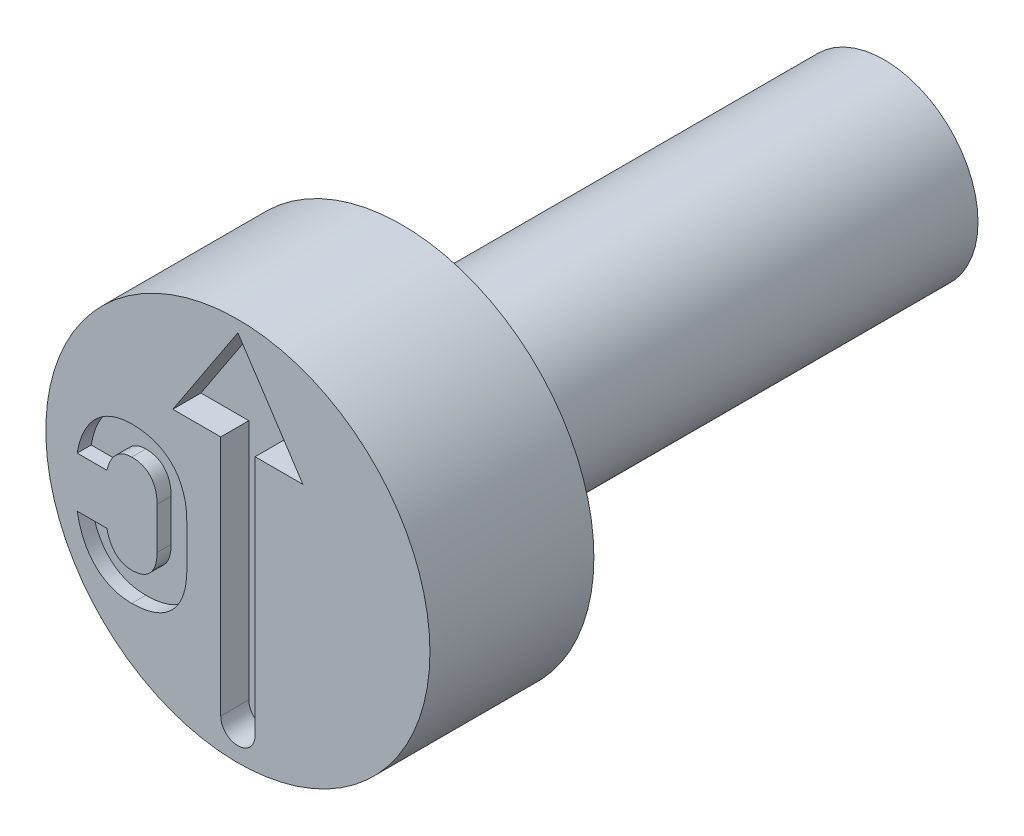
ISO-10303-21;
HEADER;
FILE_DESCRIPTION(('STEP AP214'),'2;1');
FILE_NAME('part.step','',(''),(''),'','','');
FILE_SCHEMA(('AUTOMOTIVE_DESIGN { 1 0 10303 214 1 1 1 1 }'));
ENDSEC;
DATA;
#1=APPLICATION_CONTEXT('core data for automotive mechanical design processes');
#2=APPLICATION_PROTOCOL_DEFINITION('international standard','automotive_design',2000,#1);
#3=PRODUCT_CONTEXT('',#1,'mechanical');
#4=PRODUCT('Part','Part','',(#3));
#5=PRODUCT_RELATED_PRODUCT_CATEGORY('part','',(#4));
#6=PRODUCT_DEFINITION_FORMATION('','',#4);
#7=PRODUCT_DEFINITION_CONTEXT('part definition',#1,'design');
#8=PRODUCT_DEFINITION('design','',#6,#7);
#9=PRODUCT_DEFINITION_SHAPE('','',#8);
#10=(LENGTH_UNIT() NAMED_UNIT(*) SI_UNIT(.MILLI.,.METRE.));
#11=(NAMED_UNIT(*) PLANE_ANGLE_UNIT() SI_UNIT($,.RADIAN.));
#12=(NAMED_UNIT(*) SI_UNIT($,.STERADIAN.) SOLID_ANGLE_UNIT());
#13=UNCERTAINTY_MEASURE_WITH_UNIT(LENGTH_MEASURE(1.E-05),#10,'distance_accuracy_value','');
#14=(GEOMETRIC_REPRESENTATION_CONTEXT(3) GLOBAL_UNCERTAINTY_ASSIGNED_CONTEXT((#13)) GLOBAL_UNIT_ASSIGNED_CONTEXT((#10,
#11,#12)) REPRESENTATION_CONTEXT('',''));
#15=CARTESIAN_POINT('',(0.,0.,0.));
#16=DIRECTION('',(0.,0.,1.));
#17=DIRECTION('',(1.,0.,0.));
#18=AXIS2_PLACEMENT_3D('',#15,#16,#17);
#19=CARTESIAN_POINT('',(0.,2.,-3.5));
#20=DIRECTION('',(0.,0.,1.));
#21=DIRECTION('',(1.,0.,0.));
#22=AXIS2_PLACEMENT_3D('',#19,#20,#21);
#23=PLANE('',#22);
#24=CARTESIAN_POINT('',(0.,0.,-3.5));
#25=DIRECTION('',(0.,0.,1.));
#26=DIRECTION('',(1.,0.,0.));
#27=AXIS2_PLACEMENT_3D('',#24,#25,#26);
#28=CIRCLE('',#27,4.1);
#29=CARTESIAN_POINT('',(4.1,0.,-3.5));
#30=VERTEX_POINT('',#29);
#31=EDGE_CURVE('E11',#30,#30,#28,.T.);
#32=ORIENTED_EDGE('',*,*,#31,.F.);
#33=EDGE_LOOP('',(#32));
#34=FACE_BOUND('',#33,.T.);
#35=CARTESIAN_POINT('',(0.,0.,-3.5));
#36=DIRECTION('',(0.,0.,1.));
#37=DIRECTION('',(1.,0.,0.));
#38=AXIS2_PLACEMENT_3D('',#35,#36,#37);
#39=CIRCLE('',#38,2.);
#40=CARTESIAN_POINT('',(2.,0.,-3.5));
#41=VERTEX_POINT('',#40);
#42=EDGE_CURVE('E262',#41,#41,#39,.T.);
#43=ORIENTED_EDGE('',*,*,#42,.T.);
#44=EDGE_LOOP('',(#43));
#45=FACE_BOUND('',#44,.T.);
#46=ADVANCED_FACE('F34',(#34,#45),#23,.F.);
#47=CARTESIAN_POINT('',(0.,0.,-0.403888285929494));
#48=DIRECTION('',(0.,0.,1.));
#49=DIRECTION('',(1.,0.,0.));
#50=AXIS2_PLACEMENT_3D('',#47,#48,#49);
#51=CYLINDRICAL_SURFACE('',#50,4.1);
#52=CARTESIAN_POINT('',(0.,0.,0.));
#53=DIRECTION('',(0.,0.,1.));
#54=DIRECTION('',(1.,0.,0.));
#55=AXIS2_PLACEMENT_3D('',#52,#53,#54);
#56=CIRCLE('',#55,4.1);
#57=CARTESIAN_POINT('',(4.1,0.,0.));
#58=VERTEX_POINT('',#57);
#59=EDGE_CURVE('E41',#58,#58,#56,.T.);
#60=ORIENTED_EDGE('',*,*,#59,.F.);
#61=EDGE_LOOP('',(#60));
#62=FACE_BOUND('',#61,.T.);
#63=ORIENTED_EDGE('',*,*,#31,.T.);
#64=EDGE_LOOP('',(#63));
#65=FACE_BOUND('',#64,.T.);
#66=ADVANCED_FACE('F247',(#62,#65),#51,.T.);
#67=CARTESIAN_POINT('',(0.,4.1,0.));
#68=DIRECTION('',(0.,0.,-1.));
#69=DIRECTION('',(-1.,0.,0.));
#70=AXIS2_PLACEMENT_3D('',#67,#68,#69);
#71=PLANE('',#70);
#72=CARTESIAN_POINT('',(-2.26637456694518,-2.28377827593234,0.));
#73=CARTESIAN_POINT('',(-2.23611676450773,-2.28345098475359,0.));
#74=CARTESIAN_POINT('',(-2.17640874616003,-2.28280513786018,0.));
#75=CARTESIAN_POINT('',(-2.08861293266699,-2.27608498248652,0.));
#76=CARTESIAN_POINT('',(-2.00391148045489,-2.26485126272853,0.));
#77=CARTESIAN_POINT('',(-1.92276629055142,-2.24900972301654,0.));
#78=CARTESIAN_POINT('',(-1.84495321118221,-2.22902516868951,0.));
#79=CARTESIAN_POINT('',(-1.77013909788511,-2.20540398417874,0.));
#80=CARTESIAN_POINT('',(-1.69904381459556,-2.17616201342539,0.));
#81=CARTESIAN_POINT('',(-1.63097732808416,-2.14300107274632,0.));
#82=CARTESIAN_POINT('',(-1.56689814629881,-2.10546800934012,0.));
#83=CARTESIAN_POINT('',(-1.50694206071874,-2.06325115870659,0.));
#84=CARTESIAN_POINT('',(-1.45051458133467,-2.0176750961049,0.));
#85=CARTESIAN_POINT('',(-1.39804393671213,-1.96782596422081,0.));
#86=CARTESIAN_POINT('',(-1.34958448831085,-1.91399503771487,0.));
#87=CARTESIAN_POINT('',(-1.30486067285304,-1.85612264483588,0.));
#88=CARTESIAN_POINT('',(-1.26479157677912,-1.79383958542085,0.));
#89=CARTESIAN_POINT('',(-1.22813618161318,-1.72798512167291,0.));
#90=CARTESIAN_POINT('',(-1.19552405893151,-1.65837925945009,0.));
#91=CARTESIAN_POINT('',(-1.16799907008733,-1.58468978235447,0.));
#92=CARTESIAN_POINT('',(-1.14413514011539,-1.50773038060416,0.));
#93=CARTESIAN_POINT('',(-1.12417264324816,-1.42751331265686,0.));
#94=CARTESIAN_POINT('',(-1.10888858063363,-1.34367397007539,0.));
#95=CARTESIAN_POINT('',(-1.09870080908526,-1.25627597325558,0.));
#96=CARTESIAN_POINT('',(-1.09163840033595,-1.16523707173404,0.));
#97=CARTESIAN_POINT('',(-1.09105546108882,-1.10331899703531,0.));
#98=CARTESIAN_POINT('',(-1.09075810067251,-1.07173425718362,0.));
#99=B_SPLINE_CURVE_WITH_KNOTS('',3,(#72,#73,#74,#75,#76,#77,#78,#79,#80,#81,#82,#83,#84,#85,#86,
#87,#88,#89,#90,#91,#92,#93,#94,#95,#96,#97,#98),.UNSPECIFIED.,.F.,.F.,(4,1,1,1,1,1,1,1,1,1,1,1,
1,1,1,1,1,1,1,1,1,1,1,1,4),(0.,0.0472598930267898,0.093258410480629,0.137448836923,
0.180669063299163,0.222325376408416,0.262898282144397,0.303117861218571,0.342294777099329,
0.381096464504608,0.418984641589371,0.456742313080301,0.494310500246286,0.531916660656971,
0.569787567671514,0.608434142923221,0.647492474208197,0.687453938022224,0.728384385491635,
0.770272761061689,0.813266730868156,0.85743965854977,0.903297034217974,0.950671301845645,1.),.UNSPECIFIED.);
#100=CARTESIAN_POINT('',(-2.26637456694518,-2.28377827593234,0.));
#101=VERTEX_POINT('',#100);
#102=CARTESIAN_POINT('',(-1.09075810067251,-1.07173425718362,0.));
#103=VERTEX_POINT('',#102);
#104=EDGE_CURVE('E400',#101,#103,#99,.T.);
#105=ORIENTED_EDGE('',*,*,#104,.F.);
#106=CARTESIAN_POINT('',(-3.43073160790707,-1.16114734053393,0.));
#107=CARTESIAN_POINT('',(-3.41941244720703,-1.2185769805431,0.));
#108=CARTESIAN_POINT('',(-3.39740594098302,-1.33023064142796,0.));
#109=CARTESIAN_POINT('',(-3.3479535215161,-1.48923334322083,0.));
#110=CARTESIAN_POINT('',(-3.28701195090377,-1.63532142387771,0.));
#111=CARTESIAN_POINT('',(-3.21448808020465,-1.76827576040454,0.));
#112=CARTESIAN_POINT('',(-3.12993977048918,-1.88678165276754,0.));
#113=CARTESIAN_POINT('',(-3.03538999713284,-1.99128229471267,0.));
#114=CARTESIAN_POINT('',(-2.93003975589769,-2.08089583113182,0.));
#115=CARTESIAN_POINT('',(-2.81410574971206,-2.15472177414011,0.));
#116=CARTESIAN_POINT('',(-2.68892417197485,-2.21276034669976,0.));
#117=CARTESIAN_POINT('',(-2.55518010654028,-2.25351944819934,0.));
#118=CARTESIAN_POINT('',(-2.4135627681,-2.27988852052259,0.));
#119=CARTESIAN_POINT('',(-2.3161696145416,-2.28246233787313,0.));
#120=CARTESIAN_POINT('',(-2.26637456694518,-2.28377827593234,0.));
#121=B_SPLINE_CURVE_WITH_KNOTS('',3,(#106,#107,#108,#109,#110,#111,#112,#113,#114,#115,#116,
#117,#118,#119,#120),.UNSPECIFIED.,.F.,.F.,(4,1,1,1,1,1,1,1,1,1,1,1,4),(0.,0.0988237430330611,
0.192131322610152,0.28071953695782,0.365844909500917,0.447392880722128,0.52606487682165,
0.603327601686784,0.680299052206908,0.757555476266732,0.835645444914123,0.915969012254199,1.),.UNSPECIFIED.);
#122=CARTESIAN_POINT('',(-3.43073160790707,-1.16114734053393,0.));
#123=VERTEX_POINT('',#122);
#124=EDGE_CURVE('E48',#123,#101,#121,.T.);
#125=ORIENTED_EDGE('',*,*,#124,.F.);
#126=DIRECTION('',(-1.,0.,0.));
#127=VECTOR('',#126,1.);
#128=CARTESIAN_POINT('',(-2.79622987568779,-1.16114734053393,0.));
#129=LINE('',#128,#127);
#130=CARTESIAN_POINT('',(-2.79622987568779,-1.16114734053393,0.));
#131=VERTEX_POINT('',#130);
#132=EDGE_CURVE('E185',#131,#123,#129,.T.);
#133=ORIENTED_EDGE('',*,*,#132,.F.);
#134=CARTESIAN_POINT('',(-2.26637456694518,-1.6711330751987,0.));
#135=CARTESIAN_POINT('',(-2.28826594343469,-1.67027041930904,0.));
#136=CARTESIAN_POINT('',(-2.33120341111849,-1.66857841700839,0.));
#137=CARTESIAN_POINT('',(-2.39393069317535,-1.65822034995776,0.));
#138=CARTESIAN_POINT('',(-2.45299043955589,-1.63913097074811,0.));
#139=CARTESIAN_POINT('',(-2.50878122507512,-1.61341056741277,0.));
#140=CARTESIAN_POINT('',(-2.5608940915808,-1.58018035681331,0.));
#141=CARTESIAN_POINT('',(-2.6078434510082,-1.53912237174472,0.));
#142=CARTESIAN_POINT('',(-2.65157403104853,-1.49238623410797,0.));
#143=CARTESIAN_POINT('',(-2.6904956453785,-1.43845046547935,0.));
#144=CARTESIAN_POINT('',(-2.72499815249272,-1.37809339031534,0.));
#145=CARTESIAN_POINT('',(-2.75385184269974,-1.31129180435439,0.));
#146=CARTESIAN_POINT('',(-2.77889779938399,-1.23878966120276,0.));
#147=CARTESIAN_POINT('',(-2.79033420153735,-1.1875581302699,0.));
#148=CARTESIAN_POINT('',(-2.79622987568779,-1.16114734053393,0.));
#149=B_SPLINE_CURVE_WITH_KNOTS('',3,(#134,#135,#136,#137,#138,#139,#140,#141,#142,#143,#144,
#145,#146,#147,#148),.UNSPECIFIED.,.F.,.F.,(4,1,1,1,1,1,1,1,1,1,1,1,4),(0.,0.0817564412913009,
0.160356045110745,0.236478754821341,0.312819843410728,0.389192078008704,0.466352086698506,
0.545094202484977,0.627698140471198,0.714093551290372,0.80415108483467,0.89903630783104,1.),.UNSPECIFIED.);
#150=CARTESIAN_POINT('',(-2.26637456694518,-1.6711330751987,0.));
#151=VERTEX_POINT('',#150);
#152=EDGE_CURVE('E188',#151,#131,#149,.T.);
#153=ORIENTED_EDGE('',*,*,#152,.F.);
#154=CARTESIAN_POINT('',(-1.72525983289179,-1.07173425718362,0.));
#155=CARTESIAN_POINT('',(-1.72597376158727,-1.10224096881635,0.));
#156=CARTESIAN_POINT('',(-1.72735576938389,-1.16129520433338,0.));
#157=CARTESIAN_POINT('',(-1.73932871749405,-1.24637202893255,0.));
#158=CARTESIAN_POINT('',(-1.75913723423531,-1.32462952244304,0.));
#159=CARTESIAN_POINT('',(-1.78661930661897,-1.39593428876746,0.));
#160=CARTESIAN_POINT('',(-1.82271897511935,-1.45926874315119,0.));
#161=CARTESIAN_POINT('',(-1.86558997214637,-1.51514448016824,0.));
#162=CARTESIAN_POINT('',(-1.91547998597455,-1.56342653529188,0.));
#163=CARTESIAN_POINT('',(-1.97316341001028,-1.60271029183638,0.));
#164=CARTESIAN_POINT('',(-2.03751215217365,-1.63343846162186,0.));
#165=CARTESIAN_POINT('',(-2.10827996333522,-1.65503811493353,0.));
#166=CARTESIAN_POINT('',(-2.18527827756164,-1.66859669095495,0.));
#167=CARTESIAN_POINT('',(-2.23871882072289,-1.67026810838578,0.));
#168=CARTESIAN_POINT('',(-2.26637456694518,-1.6711330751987,0.));
#169=B_SPLINE_CURVE_WITH_KNOTS('',3,(#154,#155,#156,#157,#158,#159,#160,#161,#162,#163,#164,
#165,#166,#167,#168),.UNSPECIFIED.,.F.,.F.,(4,1,1,1,1,1,1,1,1,1,1,1,4),(0.,0.0997433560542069,
0.193081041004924,0.280299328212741,0.363302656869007,0.442209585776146,0.517891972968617,
0.592965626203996,0.668275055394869,0.745143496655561,0.825309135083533,0.909596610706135,1.),.UNSPECIFIED.);
#170=CARTESIAN_POINT('',(-1.72525983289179,-1.07173425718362,0.));
#171=VERTEX_POINT('',#170);
#172=EDGE_CURVE('E348',#171,#151,#169,.T.);
#173=ORIENTED_EDGE('',*,*,#172,.F.);
#174=DIRECTION('',(0.,-1.,0.));
#175=VECTOR('',#174,1.);
#176=CARTESIAN_POINT('',(-1.72525983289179,-0.18025270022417,0.));
#177=LINE('',#176,#175);
#178=CARTESIAN_POINT('',(-1.72525983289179,-0.18025270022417,0.));
#179=VERTEX_POINT('',#178);
#180=EDGE_CURVE('E356',#179,#171,#177,.T.);
#181=ORIENTED_EDGE('',*,*,#180,.F.);
#182=CARTESIAN_POINT('',(-2.26637456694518,0.421133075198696,0.));
#183=CARTESIAN_POINT('',(-2.23873944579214,0.420165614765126,0.));
#184=CARTESIAN_POINT('',(-2.18537565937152,0.418297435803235,0.));
#185=CARTESIAN_POINT('',(-2.10806861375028,0.406126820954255,0.));
#186=CARTESIAN_POINT('',(-2.03765044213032,0.383199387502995,0.));
#187=CARTESIAN_POINT('',(-1.9731376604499,0.352783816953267,0.));
#188=CARTESIAN_POINT('',(-1.9155076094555,0.313389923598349,0.));
#189=CARTESIAN_POINT('',(-1.86537801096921,0.265096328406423,0.));
#190=CARTESIAN_POINT('',(-1.82272356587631,0.208558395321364,0.));
#191=CARTESIAN_POINT('',(-1.78678111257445,0.14474908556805,0.));
#192=CARTESIAN_POINT('',(-1.75898969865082,0.0731272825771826,0.));
#193=CARTESIAN_POINT('',(-1.73943528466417,-0.00542336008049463,0.));
#194=CARTESIAN_POINT('',(-1.7273345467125,-0.0906859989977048,0.));
#195=CARTESIAN_POINT('',(-1.72596653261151,-0.149744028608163,0.));
#196=CARTESIAN_POINT('',(-1.72525983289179,-0.18025270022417,0.));
#197=B_SPLINE_CURVE_WITH_KNOTS('',3,(#182,#183,#184,#185,#186,#187,#188,#189,#190,#191,#192,
#193,#194,#195,#196),.UNSPECIFIED.,.F.,.F.,(4,1,1,1,1,1,1,1,1,1,1,1,4),(0.,0.0902231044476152,
0.174222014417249,0.25444494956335,0.331160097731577,0.406319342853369,0.481243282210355,
0.557346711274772,0.636723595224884,0.719561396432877,0.807304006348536,0.900455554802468,1.),.UNSPECIFIED.);
#198=CARTESIAN_POINT('',(-2.26637456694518,0.421133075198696,0.));
#199=VERTEX_POINT('',#198);
#200=EDGE_CURVE('E362',#199,#179,#197,.T.);
#201=ORIENTED_EDGE('',*,*,#200,.F.);
#202=CARTESIAN_POINT('',(-2.79622987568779,-0.0881903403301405,0.));
#203=CARTESIAN_POINT('',(-2.78982976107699,-0.0622294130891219,0.));
#204=CARTESIAN_POINT('',(-2.77737571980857,-0.0117118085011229,0.));
#205=CARTESIAN_POINT('',(-2.7517337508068,0.0601538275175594,0.));
#206=CARTESIAN_POINT('',(-2.72257626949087,0.126720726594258,0.));
#207=CARTESIAN_POINT('',(-2.68691674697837,0.186402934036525,0.));
#208=CARTESIAN_POINT('',(-2.64809736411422,0.240641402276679,0.));
#209=CARTESIAN_POINT('',(-2.60431807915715,0.287631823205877,0.));
#210=CARTESIAN_POINT('',(-2.55653711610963,0.32815368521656,0.));
#211=CARTESIAN_POINT('',(-2.50512342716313,0.361668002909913,0.));
#212=CARTESIAN_POINT('',(-2.45021702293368,0.388981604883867,0.));
#213=CARTESIAN_POINT('',(-2.3915680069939,0.407057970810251,0.));
#214=CARTESIAN_POINT('',(-2.32998603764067,0.418861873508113,0.));
#215=CARTESIAN_POINT('',(-2.28784556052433,0.42036646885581,0.));
#216=CARTESIAN_POINT('',(-2.26637456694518,0.421133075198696,0.));
#217=B_SPLINE_CURVE_WITH_KNOTS('',3,(#202,#203,#204,#205,#206,#207,#208,#209,#210,#211,#212,
#213,#214,#215,#216),.UNSPECIFIED.,.F.,.F.,(4,1,1,1,1,1,1,1,1,1,1,1,4),(0.,0.100258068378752,
0.195093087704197,0.285925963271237,0.37244127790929,0.455447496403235,0.535743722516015,
0.612742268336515,0.689936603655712,0.765509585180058,0.842003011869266,0.919498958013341,1.),.UNSPECIFIED.);
#218=CARTESIAN_POINT('',(-2.79622987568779,-0.0881903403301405,0.));
#219=VERTEX_POINT('',#218);
#220=EDGE_CURVE('E367',#219,#199,#217,.T.);
#221=ORIENTED_EDGE('',*,*,#220,.F.);
#222=DIRECTION('',(1.,0.,0.));
#223=VECTOR('',#222,1.);
#224=CARTESIAN_POINT('',(-3.43073160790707,-0.0881903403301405,0.));
#225=LINE('',#224,#223);
#226=CARTESIAN_POINT('',(-3.43073160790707,-0.0881903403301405,0.));
#227=VERTEX_POINT('',#226);
#228=EDGE_CURVE('E375',#227,#219,#225,.T.);
#229=ORIENTED_EDGE('',*,*,#228,.F.);
#230=CARTESIAN_POINT('',(-2.26637456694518,1.03377827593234,0.));
#231=CARTESIAN_POINT('',(-2.3161671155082,1.03244579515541,0.));
#232=CARTESIAN_POINT('',(-2.41377291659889,1.02983380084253,0.));
#233=CARTESIAN_POINT('',(-2.55563535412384,1.00360760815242,0.));
#234=CARTESIAN_POINT('',(-2.68959985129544,0.962776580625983,0.));
#235=CARTESIAN_POINT('',(-2.81488347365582,0.90455505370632,0.));
#236=CARTESIAN_POINT('',(-2.93109400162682,0.831097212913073,0.));
#237=CARTESIAN_POINT('',(-3.0368708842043,0.741721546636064,0.));
#238=CARTESIAN_POINT('',(-3.13217854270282,0.637598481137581,0.));
#239=CARTESIAN_POINT('',(-3.21619428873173,0.51830227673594,0.));
#240=CARTESIAN_POINT('',(-3.28915744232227,0.385497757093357,0.));
#241=CARTESIAN_POINT('',(-3.3492234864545,0.239168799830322,0.));
#242=CARTESIAN_POINT('',(-3.39797929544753,0.0804063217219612,0.));
#243=CARTESIAN_POINT('',(-3.41961902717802,-0.0309869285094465,0.));
#244=CARTESIAN_POINT('',(-3.43073160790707,-0.0881903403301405,0.));
#245=B_SPLINE_CURVE_WITH_KNOTS('',3,(#230,#231,#232,#233,#234,#235,#236,#237,#238,#239,#240,
#241,#242,#243,#244),.UNSPECIFIED.,.F.,.F.,(4,1,1,1,1,1,1,1,1,1,1,1,4),(0.,0.0840057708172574,
0.164672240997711,0.242738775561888,0.319972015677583,0.397234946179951,0.474233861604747,
0.553133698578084,0.634960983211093,0.720060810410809,0.808478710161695,0.901648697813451,1.),.UNSPECIFIED.);
#246=CARTESIAN_POINT('',(-2.26637456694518,1.03377827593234,0.));
#247=VERTEX_POINT('',#246);
#248=EDGE_CURVE('E381',#247,#227,#245,.T.);
#249=ORIENTED_EDGE('',*,*,#248,.F.);
#250=CARTESIAN_POINT('',(-1.09075810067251,-0.18025270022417,0.));
#251=CARTESIAN_POINT('',(-1.09105546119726,-0.148667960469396,0.));
#252=CARTESIAN_POINT('',(-1.09163840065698,-0.0867498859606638,0.));
#253=CARTESIAN_POINT('',(-1.09870080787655,0.00428901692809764,0.));
#254=CARTESIAN_POINT('',(-1.10888858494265,0.0916870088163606,0.));
#255=CARTESIAN_POINT('',(-1.12417262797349,0.175526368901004,0.));
#256=CARTESIAN_POINT('',(-1.14413519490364,0.255743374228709,0.));
#257=CARTESIAN_POINT('',(-1.16799887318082,0.332703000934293,0.));
#258=CARTESIAN_POINT('',(-1.19552476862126,0.406391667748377,0.));
#259=CARTESIAN_POINT('',(-1.22813362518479,0.476000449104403,0.));
#260=CARTESIAN_POINT('',(-1.26480084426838,0.541844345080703,0.));
#261=CARTESIAN_POINT('',(-1.30482675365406,0.604166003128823,0.));
#262=CARTESIAN_POINT('',(-1.34980896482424,0.66202770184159,0.));
#263=CARTESIAN_POINT('',(-1.39780818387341,0.716491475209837,0.));
#264=CARTESIAN_POINT('',(-1.45054412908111,0.766326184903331,0.));
#265=CARTESIAN_POINT('',(-1.50694052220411,0.811919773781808,0.));
#266=CARTESIAN_POINT('',(-1.56687430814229,0.854195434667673,0.));
#267=CARTESIAN_POINT('',(-1.63116216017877,0.89151789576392,0.));
#268=CARTESIAN_POINT('',(-1.69883662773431,0.925717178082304,0.));
#269=CARTESIAN_POINT('',(-1.77030025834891,0.954495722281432,0.));
#270=CARTESIAN_POINT('',(-1.84480651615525,0.97924703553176,0.));
#271=CARTESIAN_POINT('',(-1.92278894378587,0.998942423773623,0.));
#272=CARTESIAN_POINT('',(-2.0039051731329,1.01487000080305,0.));
#273=CARTESIAN_POINT('',(-2.08861470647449,1.0260797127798,0.));
#274=CARTESIAN_POINT('',(-2.17640828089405,1.0328065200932,0.));
#275=CARTESIAN_POINT('',(-2.2361166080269,1.03345144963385,0.));
#276=CARTESIAN_POINT('',(-2.26637456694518,1.03377827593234,0.));
#277=B_SPLINE_CURVE_WITH_KNOTS('',3,(#250,#251,#252,#253,#254,#255,#256,#257,#258,#259,#260,
#261,#262,#263,#264,#265,#266,#267,#268,#269,#270,#271,#272,#273,#274,#275,#276),.UNSPECIFIED.,
.F.,.F.,(4,1,1,1,1,1,1,1,1,1,1,1,1,1,1,1,1,1,1,1,1,1,1,1,4),(0.,0.049303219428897,
0.0966530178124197,0.142486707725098,0.186636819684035,0.229608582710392,0.271475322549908,
0.312384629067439,0.352325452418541,0.391363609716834,0.429990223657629,0.467841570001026,
0.505685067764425,0.543233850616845,0.580972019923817,0.618840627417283,0.657622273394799,
0.69693189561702,0.737130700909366,0.777789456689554,0.819424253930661,0.862622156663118,
0.906789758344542,0.952764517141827,1.),.UNSPECIFIED.);
#278=CARTESIAN_POINT('',(-1.09075810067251,-0.18025270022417,0.));
#279=VERTEX_POINT('',#278);
#280=EDGE_CURVE('E386',#279,#247,#277,.T.);
#281=ORIENTED_EDGE('',*,*,#280,.F.);
#282=DIRECTION('',(0.,1.,0.));
#283=VECTOR('',#282,1.);
#284=CARTESIAN_POINT('',(-1.09075810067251,-1.07173425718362,0.));
#285=LINE('',#284,#283);
#286=EDGE_CURVE('E394',#103,#279,#285,.T.);
#287=ORIENTED_EDGE('',*,*,#286,.F.);
#288=EDGE_LOOP('',(#105,#125,#133,#153,#173,#181,#201,#221,#229,#249,#281,#287));
#289=FACE_BOUND('',#288,.T.);
#290=DIRECTION('',(0.,1.,0.));
#291=VECTOR('',#290,1.);
#292=CARTESIAN_POINT('',(0.366422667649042,1.74359356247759,0.));
#293=LINE('',#292,#291);
#294=CARTESIAN_POINT('',(0.366422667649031,-3.4168913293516,0.));
#295=VERTEX_POINT('',#294);
#296=CARTESIAN_POINT('',(0.366422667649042,1.74359356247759,0.));
#297=VERTEX_POINT('',#296);
#298=EDGE_CURVE('E300',#295,#297,#293,.T.);
#299=ORIENTED_EDGE('',*,*,#298,.F.);
#300=CARTESIAN_POINT('',(3.14387868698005E-13,-3.4168913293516,0.));
#301=DIRECTION('',(0.,0.,1.));
#302=DIRECTION('',(1.,0.,0.));
#303=AXIS2_PLACEMENT_3D('',#300,#301,#302);
#304=CIRCLE('',#303,0.366422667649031);
#305=CARTESIAN_POINT('',(-0.366422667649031,-3.4168913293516,0.));
#306=VERTEX_POINT('',#305);
#307=EDGE_CURVE('E56',#306,#295,#304,.T.);
#308=ORIENTED_EDGE('',*,*,#307,.F.);
#309=DIRECTION('',(0.,-1.,0.));
#310=VECTOR('',#309,1.);
#311=CARTESIAN_POINT('',(-0.366422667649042,1.74359356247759,0.));
#312=LINE('',#311,#310);
#313=CARTESIAN_POINT('',(-0.366422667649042,1.74359356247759,0.));
#314=VERTEX_POINT('',#313);
#315=EDGE_CURVE('E284',#314,#306,#312,.T.);
#316=ORIENTED_EDGE('',*,*,#315,.F.);
#317=DIRECTION('',(1.,0.,0.));
#318=VECTOR('',#317,1.);
#319=CARTESIAN_POINT('',(-1.38878912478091,1.74359356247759,0.));
#320=LINE('',#319,#318);
#321=CARTESIAN_POINT('',(-1.38878912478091,1.74359356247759,0.));
#322=VERTEX_POINT('',#321);
#323=EDGE_CURVE('E288',#322,#314,#320,.T.);
#324=ORIENTED_EDGE('',*,*,#323,.F.);
#325=DIRECTION('',(-0.550159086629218,-0.835059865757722,0.));
#326=VECTOR('',#325,1.);
#327=CARTESIAN_POINT('',(0.,3.85156939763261,0.));
#328=LINE('',#327,#326);
#329=CARTESIAN_POINT('',(0.,3.85156939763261,0.));
#330=VERTEX_POINT('',#329);
#331=EDGE_CURVE('E291',#330,#322,#328,.T.);
#332=ORIENTED_EDGE('',*,*,#331,.F.);
#333=DIRECTION('',(-0.550159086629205,0.835059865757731,0.));
#334=VECTOR('',#333,1.);
#335=CARTESIAN_POINT('',(0.,3.85156939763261,0.));
#336=LINE('',#335,#334);
#337=CARTESIAN_POINT('',(1.38878912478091,1.74359356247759,0.));
#338=VERTEX_POINT('',#337);
#339=EDGE_CURVE('E294',#338,#330,#336,.T.);
#340=ORIENTED_EDGE('',*,*,#339,.F.);
#341=DIRECTION('',(1.,0.,0.));
#342=VECTOR('',#341,1.);
#343=CARTESIAN_POINT('',(1.38878912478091,1.74359356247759,0.));
#344=LINE('',#343,#342);
#345=EDGE_CURVE('E297',#297,#338,#344,.T.);
#346=ORIENTED_EDGE('',*,*,#345,.F.);
#347=EDGE_LOOP('',(#299,#308,#316,#324,#332,#340,#346));
#348=FACE_BOUND('',#347,.T.);
#349=ORIENTED_EDGE('',*,*,#59,.T.);
#350=EDGE_LOOP('',(#349));
#351=FACE_BOUND('',#350,.T.);
#352=ADVANCED_FACE('F244',(#289,#348,#351),#71,.F.);
#353=CARTESIAN_POINT('',(0.,0.,-13.8));
#354=DIRECTION('',(0.,0.,1.));
#355=DIRECTION('',(1.,0.,0.));
#356=AXIS2_PLACEMENT_3D('',#353,#354,#355);
#357=PLANE('',#356);
#358=CARTESIAN_POINT('',(0.,0.,-13.8));
#359=DIRECTION('',(0.,0.,1.));
#360=DIRECTION('',(1.,0.,0.));
#361=AXIS2_PLACEMENT_3D('',#358,#359,#360);
#362=CIRCLE('',#361,2.);
#363=CARTESIAN_POINT('',(2.,0.,-13.8));
#364=VERTEX_POINT('',#363);
#365=EDGE_CURVE('E263',#364,#364,#362,.T.);
#366=ORIENTED_EDGE('',*,*,#365,.F.);
#367=EDGE_LOOP('',(#366));
#368=FACE_BOUND('',#367,.T.);
#369=ADVANCED_FACE('F240',(#368),#357,.F.);
#370=CARTESIAN_POINT('',(0.,0.,-0.403888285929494));
#371=DIRECTION('',(0.,0.,1.));
#372=DIRECTION('',(1.,0.,0.));
#373=AXIS2_PLACEMENT_3D('',#370,#371,#372);
#374=CYLINDRICAL_SURFACE('',#373,2.);
#375=ORIENTED_EDGE('',*,*,#42,.F.);
#376=EDGE_LOOP('',(#375));
#377=FACE_BOUND('',#376,.T.);
#378=ORIENTED_EDGE('',*,*,#365,.T.);
#379=EDGE_LOOP('',(#378));
#380=FACE_BOUND('',#379,.T.);
#381=ADVANCED_FACE('F237',(#377,#380),#374,.T.);
#382=CARTESIAN_POINT('',(3.14387868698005E-13,-3.4168913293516,-0.6));
#383=DIRECTION('',(0.,0.,1.));
#384=DIRECTION('',(1.,0.,0.));
#385=AXIS2_PLACEMENT_3D('',#382,#383,#384);
#386=CYLINDRICAL_SURFACE('',#385,0.366422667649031);
#387=ORIENTED_EDGE('',*,*,#307,.T.);
#388=DIRECTION('',(0.,0.,1.));
#389=VECTOR('',#388,1.);
#390=CARTESIAN_POINT('',(0.366422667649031,-3.4168913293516,-0.6));
#391=LINE('',#390,#389);
#392=CARTESIAN_POINT('',(0.366422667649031,-3.4168913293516,-0.6));
#393=VERTEX_POINT('',#392);
#394=EDGE_CURVE('E271',#393,#295,#391,.T.);
#395=ORIENTED_EDGE('',*,*,#394,.F.);
#396=CARTESIAN_POINT('',(3.14387868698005E-13,-3.4168913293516,-0.6));
#397=DIRECTION('',(0.,0.,1.));
#398=DIRECTION('',(1.,0.,0.));
#399=AXIS2_PLACEMENT_3D('',#396,#397,#398);
#400=CIRCLE('',#399,0.366422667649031);
#401=CARTESIAN_POINT('',(-0.366422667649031,-3.4168913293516,-0.6));
#402=VERTEX_POINT('',#401);
#403=EDGE_CURVE('E287',#402,#393,#400,.T.);
#404=ORIENTED_EDGE('',*,*,#403,.F.);
#405=DIRECTION('',(0.,0.,1.));
#406=VECTOR('',#405,1.);
#407=CARTESIAN_POINT('',(-0.366422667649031,-3.4168913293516,-0.6));
#408=LINE('',#407,#406);
#409=EDGE_CURVE('E264',#402,#306,#408,.T.);
#410=ORIENTED_EDGE('',*,*,#409,.T.);
#411=EDGE_LOOP('',(#387,#395,#404,#410));
#412=FACE_BOUND('',#411,.T.);
#413=ADVANCED_FACE('F215',(#412),#386,.F.);
#414=CARTESIAN_POINT('',(-0.366422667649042,1.74359356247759,-0.6));
#415=DIRECTION('',(-1.,0.,0.));
#416=DIRECTION('',(0.,-1.,0.));
#417=AXIS2_PLACEMENT_3D('',#414,#415,#416);
#418=PLANE('',#417);
#419=ORIENTED_EDGE('',*,*,#315,.T.);
#420=ORIENTED_EDGE('',*,*,#409,.F.);
#421=DIRECTION('',(0.,-1.,0.));
#422=VECTOR('',#421,1.);
#423=CARTESIAN_POINT('',(-0.366422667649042,1.74359356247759,-0.6));
#424=LINE('',#423,#422);
#425=CARTESIAN_POINT('',(-0.366422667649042,1.74359356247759,-0.6));
#426=VERTEX_POINT('',#425);
#427=EDGE_CURVE('E275',#426,#402,#424,.T.);
#428=ORIENTED_EDGE('',*,*,#427,.F.);
#429=DIRECTION('',(0.,0.,1.));
#430=VECTOR('',#429,1.);
#431=CARTESIAN_POINT('',(-0.366422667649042,1.74359356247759,-0.6));
#432=LINE('',#431,#430);
#433=EDGE_CURVE('E268',#426,#314,#432,.T.);
#434=ORIENTED_EDGE('',*,*,#433,.T.);
#435=EDGE_LOOP('',(#419,#420,#428,#434));
#436=FACE_BOUND('',#435,.T.);
#437=ADVANCED_FACE('F211',(#436),#418,.F.);
#438=CARTESIAN_POINT('',(-1.38878912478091,1.74359356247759,-0.6));
#439=DIRECTION('',(0.,-1.,0.));
#440=DIRECTION('',(0.,0.,-1.));
#441=AXIS2_PLACEMENT_3D('',#438,#439,#440);
#442=PLANE('',#441);
#443=ORIENTED_EDGE('',*,*,#323,.T.);
#444=ORIENTED_EDGE('',*,*,#433,.F.);
#445=DIRECTION('',(1.,0.,0.));
#446=VECTOR('',#445,1.);
#447=CARTESIAN_POINT('',(-1.38878912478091,1.74359356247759,-0.6));
#448=LINE('',#447,#446);
#449=CARTESIAN_POINT('',(-1.38878912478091,1.74359356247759,-0.6));
#450=VERTEX_POINT('',#449);
#451=EDGE_CURVE('E307',#450,#426,#448,.T.);
#452=ORIENTED_EDGE('',*,*,#451,.F.);
#453=DIRECTION('',(0.,0.,1.));
#454=VECTOR('',#453,1.);
#455=CARTESIAN_POINT('',(-1.38878912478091,1.74359356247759,-0.6));
#456=LINE('',#455,#454);
#457=EDGE_CURVE('E281',#450,#322,#456,.T.);
#458=ORIENTED_EDGE('',*,*,#457,.T.);
#459=EDGE_LOOP('',(#443,#444,#452,#458));
#460=FACE_BOUND('',#459,.T.);
#461=ADVANCED_FACE('F214',(#460),#442,.F.);
#462=CARTESIAN_POINT('',(0.,3.85156939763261,-0.6));
#463=DIRECTION('',(-0.835059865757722,0.550159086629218,0.));
#464=DIRECTION('',(-0.550159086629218,-0.835059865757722,0.));
#465=AXIS2_PLACEMENT_3D('',#462,#463,#464);
#466=PLANE('',#465);
#467=ORIENTED_EDGE('',*,*,#331,.T.);
#468=ORIENTED_EDGE('',*,*,#457,.F.);
#469=DIRECTION('',(-0.550159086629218,-0.835059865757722,0.));
#470=VECTOR('',#469,1.);
#471=CARTESIAN_POINT('',(0.,3.85156939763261,-0.6));
#472=LINE('',#471,#470);
#473=CARTESIAN_POINT('',(0.,3.85156939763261,-0.6));
#474=VERTEX_POINT('',#473);
#475=EDGE_CURVE('E310',#474,#450,#472,.T.);
#476=ORIENTED_EDGE('',*,*,#475,.F.);
#477=DIRECTION('',(0.,0.,1.));
#478=VECTOR('',#477,1.);
#479=CARTESIAN_POINT('',(0.,3.85156939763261,-0.6));
#480=LINE('',#479,#478);
#481=EDGE_CURVE('E279',#474,#330,#480,.T.);
#482=ORIENTED_EDGE('',*,*,#481,.T.);
#483=EDGE_LOOP('',(#467,#468,#476,#482));
#484=FACE_BOUND('',#483,.T.);
#485=ADVANCED_FACE('F219',(#484),#466,.F.);
#486=CARTESIAN_POINT('',(0.,3.85156939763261,-0.6));
#487=DIRECTION('',(0.835059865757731,0.550159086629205,0.));
#488=DIRECTION('',(-0.550159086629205,0.835059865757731,0.));
#489=AXIS2_PLACEMENT_3D('',#486,#487,#488);
#490=PLANE('',#489);
#491=ORIENTED_EDGE('',*,*,#339,.T.);
#492=ORIENTED_EDGE('',*,*,#481,.F.);
#493=DIRECTION('',(-0.550159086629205,0.835059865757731,0.));
#494=VECTOR('',#493,1.);
#495=CARTESIAN_POINT('',(0.,3.85156939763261,-0.6));
#496=LINE('',#495,#494);
#497=CARTESIAN_POINT('',(1.38878912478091,1.74359356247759,-0.6));
#498=VERTEX_POINT('',#497);
#499=EDGE_CURVE('E313',#498,#474,#496,.T.);
#500=ORIENTED_EDGE('',*,*,#499,.F.);
#501=DIRECTION('',(0.,0.,1.));
#502=VECTOR('',#501,1.);
#503=CARTESIAN_POINT('',(1.38878912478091,1.74359356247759,-0.6));
#504=LINE('',#503,#502);
#505=EDGE_CURVE('E277',#498,#338,#504,.T.);
#506=ORIENTED_EDGE('',*,*,#505,.T.);
#507=EDGE_LOOP('',(#491,#492,#500,#506));
#508=FACE_BOUND('',#507,.T.);
#509=ADVANCED_FACE('F223',(#508),#490,.F.);
#510=CARTESIAN_POINT('',(1.38878912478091,1.74359356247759,-0.6));
#511=DIRECTION('',(0.,-1.,0.));
#512=DIRECTION('',(0.,0.,-1.));
#513=AXIS2_PLACEMENT_3D('',#510,#511,#512);
#514=PLANE('',#513);
#515=ORIENTED_EDGE('',*,*,#345,.T.);
#516=ORIENTED_EDGE('',*,*,#505,.F.);
#517=DIRECTION('',(1.,0.,0.));
#518=VECTOR('',#517,1.);
#519=CARTESIAN_POINT('',(1.38878912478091,1.74359356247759,-0.6));
#520=LINE('',#519,#518);
#521=CARTESIAN_POINT('',(0.366422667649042,1.74359356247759,-0.6));
#522=VERTEX_POINT('',#521);
#523=EDGE_CURVE('E316',#522,#498,#520,.T.);
#524=ORIENTED_EDGE('',*,*,#523,.F.);
#525=DIRECTION('',(0.,0.,1.));
#526=VECTOR('',#525,1.);
#527=CARTESIAN_POINT('',(0.366422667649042,1.74359356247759,-0.6));
#528=LINE('',#527,#526);
#529=EDGE_CURVE('E274',#522,#297,#528,.T.);
#530=ORIENTED_EDGE('',*,*,#529,.T.);
#531=EDGE_LOOP('',(#515,#516,#524,#530));
#532=FACE_BOUND('',#531,.T.);
#533=ADVANCED_FACE('F227',(#532),#514,.F.);
#534=CARTESIAN_POINT('',(0.366422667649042,1.74359356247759,-0.6));
#535=DIRECTION('',(1.,0.,0.));
#536=DIRECTION('',(0.,1.,0.));
#537=AXIS2_PLACEMENT_3D('',#534,#535,#536);
#538=PLANE('',#537);
#539=ORIENTED_EDGE('',*,*,#298,.T.);
#540=ORIENTED_EDGE('',*,*,#529,.F.);
#541=DIRECTION('',(0.,1.,0.));
#542=VECTOR('',#541,1.);
#543=CARTESIAN_POINT('',(0.366422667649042,1.74359356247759,-0.6));
#544=LINE('',#543,#542);
#545=EDGE_CURVE('E319',#393,#522,#544,.T.);
#546=ORIENTED_EDGE('',*,*,#545,.F.);
#547=ORIENTED_EDGE('',*,*,#394,.T.);
#548=EDGE_LOOP('',(#539,#540,#546,#547));
#549=FACE_BOUND('',#548,.T.);
#550=ADVANCED_FACE('F209',(#549),#538,.F.);
#551=CARTESIAN_POINT('',(3.14387868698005E-13,-3.4168913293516,-0.6));
#552=DIRECTION('',(0.,0.,1.));
#553=DIRECTION('',(1.,0.,0.));
#554=AXIS2_PLACEMENT_3D('',#551,#552,#553);
#555=PLANE('',#554);
#556=ORIENTED_EDGE('',*,*,#403,.T.);
#557=ORIENTED_EDGE('',*,*,#545,.T.);
#558=ORIENTED_EDGE('',*,*,#523,.T.);
#559=ORIENTED_EDGE('',*,*,#499,.T.);
#560=ORIENTED_EDGE('',*,*,#475,.T.);
#561=ORIENTED_EDGE('',*,*,#451,.T.);
#562=ORIENTED_EDGE('',*,*,#427,.T.);
#563=EDGE_LOOP('',(#556,#557,#558,#559,#560,#561,#562));
#564=FACE_BOUND('',#563,.T.);
#565=ADVANCED_FACE('F205',(#564),#555,.T.);
#566=CARTESIAN_POINT('',(-3.43073160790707,-1.16114734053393,-0.3));
#567=CARTESIAN_POINT('',(-3.41941244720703,-1.2185769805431,-0.3));
#568=CARTESIAN_POINT('',(-3.39740594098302,-1.33023064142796,-0.3));
#569=CARTESIAN_POINT('',(-3.3479535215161,-1.48923334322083,-0.3));
#570=CARTESIAN_POINT('',(-3.28701195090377,-1.63532142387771,-0.3));
#571=CARTESIAN_POINT('',(-3.21448808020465,-1.76827576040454,-0.3));
#572=CARTESIAN_POINT('',(-3.12993977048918,-1.88678165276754,-0.3));
#573=CARTESIAN_POINT('',(-3.03538999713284,-1.99128229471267,-0.3));
#574=CARTESIAN_POINT('',(-2.93003975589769,-2.08089583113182,-0.3));
#575=CARTESIAN_POINT('',(-2.81410574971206,-2.15472177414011,-0.3));
#576=CARTESIAN_POINT('',(-2.68892417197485,-2.21276034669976,-0.3));
#577=CARTESIAN_POINT('',(-2.55518010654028,-2.25351944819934,-0.3));
#578=CARTESIAN_POINT('',(-2.4135627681,-2.27988852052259,-0.3));
#579=CARTESIAN_POINT('',(-2.3161696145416,-2.28246233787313,-0.3));
#580=CARTESIAN_POINT('',(-2.26637456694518,-2.28377827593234,-0.3));
#581=B_SPLINE_CURVE_WITH_KNOTS('',3,(#566,#567,#568,#569,#570,#571,#572,#573,#574,#575,#576,
#577,#578,#579,#580),.UNSPECIFIED.,.F.,.F.,(4,1,1,1,1,1,1,1,1,1,1,1,4),(0.,0.0988237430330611,
0.192131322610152,0.28071953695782,0.365844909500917,0.447392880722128,0.52606487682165,
0.603327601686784,0.680299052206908,0.757555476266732,0.835645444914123,0.915969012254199,1.),.UNSPECIFIED.);
#582=DIRECTION('',(0.,0.,1.));
#583=VECTOR('',#582,1.);
#584=SURFACE_OF_LINEAR_EXTRUSION('',#581,#583);
#585=ORIENTED_EDGE('',*,*,#124,.T.);
#586=DIRECTION('',(0.,0.,1.));
#587=VECTOR('',#586,1.);
#588=CARTESIAN_POINT('',(-2.26637456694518,-2.28377827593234,-0.3));
#589=LINE('',#588,#587);
#590=CARTESIAN_POINT('',(-2.26637456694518,-2.28377827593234,-0.3));
#591=VERTEX_POINT('',#590);
#592=EDGE_CURVE('E162',#591,#101,#589,.T.);
#593=ORIENTED_EDGE('',*,*,#592,.F.);
#594=CARTESIAN_POINT('',(-3.43073160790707,-1.16114734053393,-0.3));
#595=VERTEX_POINT('',#594);
#596=EDGE_CURVE('E166',#595,#591,#581,.T.);
#597=ORIENTED_EDGE('',*,*,#596,.F.);
#598=DIRECTION('',(0.,0.,1.));
#599=VECTOR('',#598,1.);
#600=CARTESIAN_POINT('',(-3.43073160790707,-1.16114734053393,-0.3));
#601=LINE('',#600,#599);
#602=EDGE_CURVE('E304',#595,#123,#601,.T.);
#603=ORIENTED_EDGE('',*,*,#602,.T.);
#604=EDGE_LOOP('',(#585,#593,#597,#603));
#605=FACE_BOUND('',#604,.T.);
#606=ADVANCED_FACE('F164',(#605),#584,.F.);
#607=CARTESIAN_POINT('',(-2.79622987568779,-1.16114734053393,-0.3));
#608=DIRECTION('',(0.,1.,0.));
#609=DIRECTION('',(0.,0.,1.));
#610=AXIS2_PLACEMENT_3D('',#607,#608,#609);
#611=PLANE('',#610);
#612=ORIENTED_EDGE('',*,*,#132,.T.);
#613=ORIENTED_EDGE('',*,*,#602,.F.);
#614=DIRECTION('',(-1.,0.,0.));
#615=VECTOR('',#614,1.);
#616=CARTESIAN_POINT('',(-2.79622987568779,-1.16114734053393,-0.3));
#617=LINE('',#616,#615);
#618=CARTESIAN_POINT('',(-2.79622987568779,-1.16114734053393,-0.3));
#619=VERTEX_POINT('',#618);
#620=EDGE_CURVE('E172',#619,#595,#617,.T.);
#621=ORIENTED_EDGE('',*,*,#620,.F.);
#622=DIRECTION('',(0.,0.,1.));
#623=VECTOR('',#622,1.);
#624=CARTESIAN_POINT('',(-2.79622987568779,-1.16114734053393,-0.3));
#625=LINE('',#624,#623);
#626=EDGE_CURVE('E341',#619,#131,#625,.T.);
#627=ORIENTED_EDGE('',*,*,#626,.T.);
#628=EDGE_LOOP('',(#612,#613,#621,#627));
#629=FACE_BOUND('',#628,.T.);
#630=ADVANCED_FACE('F204',(#629),#611,.F.);
#631=CARTESIAN_POINT('',(-2.26637456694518,-1.6711330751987,-0.3));
#632=CARTESIAN_POINT('',(-2.28826594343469,-1.67027041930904,-0.3));
#633=CARTESIAN_POINT('',(-2.33120341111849,-1.66857841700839,-0.3));
#634=CARTESIAN_POINT('',(-2.39393069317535,-1.65822034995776,-0.3));
#635=CARTESIAN_POINT('',(-2.45299043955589,-1.63913097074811,-0.3));
#636=CARTESIAN_POINT('',(-2.50878122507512,-1.61341056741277,-0.3));
#637=CARTESIAN_POINT('',(-2.5608940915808,-1.58018035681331,-0.3));
#638=CARTESIAN_POINT('',(-2.6078434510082,-1.53912237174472,-0.3));
#639=CARTESIAN_POINT('',(-2.65157403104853,-1.49238623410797,-0.3));
#640=CARTESIAN_POINT('',(-2.6904956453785,-1.43845046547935,-0.3));
#641=CARTESIAN_POINT('',(-2.72499815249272,-1.37809339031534,-0.3));
#642=CARTESIAN_POINT('',(-2.75385184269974,-1.31129180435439,-0.3));
#643=CARTESIAN_POINT('',(-2.77889779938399,-1.23878966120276,-0.3));
#644=CARTESIAN_POINT('',(-2.79033420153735,-1.1875581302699,-0.3));
#645=CARTESIAN_POINT('',(-2.79622987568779,-1.16114734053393,-0.3));
#646=B_SPLINE_CURVE_WITH_KNOTS('',3,(#631,#632,#633,#634,#635,#636,#637,#638,#639,#640,#641,
#642,#643,#644,#645),.UNSPECIFIED.,.F.,.F.,(4,1,1,1,1,1,1,1,1,1,1,1,4),(0.,0.0817564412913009,
0.160356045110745,0.236478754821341,0.312819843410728,0.389192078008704,0.466352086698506,
0.545094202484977,0.627698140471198,0.714093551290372,0.80415108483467,0.89903630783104,1.),.UNSPECIFIED.);
#647=DIRECTION('',(0.,0.,1.));
#648=VECTOR('',#647,1.);
#649=SURFACE_OF_LINEAR_EXTRUSION('',#646,#648);
#650=ORIENTED_EDGE('',*,*,#152,.T.);
#651=ORIENTED_EDGE('',*,*,#626,.F.);
#652=CARTESIAN_POINT('',(-2.26637456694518,-1.6711330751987,-0.3));
#653=VERTEX_POINT('',#652);
#654=EDGE_CURVE('E414',#653,#619,#646,.T.);
#655=ORIENTED_EDGE('',*,*,#654,.F.);
#656=DIRECTION('',(0.,0.,1.));
#657=VECTOR('',#656,1.);
#658=CARTESIAN_POINT('',(-2.26637456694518,-1.6711330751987,-0.3));
#659=LINE('',#658,#657);
#660=EDGE_CURVE('E339',#653,#151,#659,.T.);
#661=ORIENTED_EDGE('',*,*,#660,.T.);
#662=EDGE_LOOP('',(#650,#651,#655,#661));
#663=FACE_BOUND('',#662,.T.);
#664=ADVANCED_FACE('F428',(#663),#649,.F.);
#665=CARTESIAN_POINT('',(-1.72525983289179,-1.07173425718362,-0.3));
#666=CARTESIAN_POINT('',(-1.72597376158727,-1.10224096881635,-0.3));
#667=CARTESIAN_POINT('',(-1.72735576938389,-1.16129520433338,-0.3));
#668=CARTESIAN_POINT('',(-1.73932871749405,-1.24637202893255,-0.3));
#669=CARTESIAN_POINT('',(-1.75913723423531,-1.32462952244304,-0.3));
#670=CARTESIAN_POINT('',(-1.78661930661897,-1.39593428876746,-0.3));
#671=CARTESIAN_POINT('',(-1.82271897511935,-1.45926874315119,-0.3));
#672=CARTESIAN_POINT('',(-1.86558997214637,-1.51514448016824,-0.3));
#673=CARTESIAN_POINT('',(-1.91547998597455,-1.56342653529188,-0.3));
#674=CARTESIAN_POINT('',(-1.97316341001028,-1.60271029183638,-0.3));
#675=CARTESIAN_POINT('',(-2.03751215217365,-1.63343846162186,-0.3));
#676=CARTESIAN_POINT('',(-2.10827996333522,-1.65503811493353,-0.3));
#677=CARTESIAN_POINT('',(-2.18527827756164,-1.66859669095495,-0.3));
#678=CARTESIAN_POINT('',(-2.23871882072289,-1.67026810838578,-0.3));
#679=CARTESIAN_POINT('',(-2.26637456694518,-1.6711330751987,-0.3));
#680=B_SPLINE_CURVE_WITH_KNOTS('',3,(#665,#666,#667,#668,#669,#670,#671,#672,#673,#674,#675,
#676,#677,#678,#679),.UNSPECIFIED.,.F.,.F.,(4,1,1,1,1,1,1,1,1,1,1,1,4),(0.,0.0997433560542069,
0.193081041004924,0.280299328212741,0.363302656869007,0.442209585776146,0.517891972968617,
0.592965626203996,0.668275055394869,0.745143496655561,0.825309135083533,0.909596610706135,1.),.UNSPECIFIED.);
#681=DIRECTION('',(0.,0.,1.));
#682=VECTOR('',#681,1.);
#683=SURFACE_OF_LINEAR_EXTRUSION('',#680,#682);
#684=ORIENTED_EDGE('',*,*,#172,.T.);
#685=ORIENTED_EDGE('',*,*,#660,.F.);
#686=CARTESIAN_POINT('',(-1.72525983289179,-1.07173425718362,-0.3));
#687=VERTEX_POINT('',#686);
#688=EDGE_CURVE('E419',#687,#653,#680,.T.);
#689=ORIENTED_EDGE('',*,*,#688,.F.);
#690=DIRECTION('',(0.,0.,1.));
#691=VECTOR('',#690,1.);
#692=CARTESIAN_POINT('',(-1.72525983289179,-1.07173425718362,-0.3));
#693=LINE('',#692,#691);
#694=EDGE_CURVE('E337',#687,#171,#693,.T.);
#695=ORIENTED_EDGE('',*,*,#694,.T.);
#696=EDGE_LOOP('',(#684,#685,#689,#695));
#697=FACE_BOUND('',#696,.T.);
#698=ADVANCED_FACE('F432',(#697),#683,.F.);
#699=CARTESIAN_POINT('',(-1.72525983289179,-0.18025270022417,-0.3));
#700=DIRECTION('',(-1.,0.,0.));
#701=DIRECTION('',(0.,0.,1.));
#702=AXIS2_PLACEMENT_3D('',#699,#700,#701);
#703=PLANE('',#702);
#704=ORIENTED_EDGE('',*,*,#180,.T.);
#705=ORIENTED_EDGE('',*,*,#694,.F.);
#706=DIRECTION('',(0.,-1.,0.));
#707=VECTOR('',#706,1.);
#708=CARTESIAN_POINT('',(-1.72525983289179,-0.18025270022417,-0.3));
#709=LINE('',#708,#707);
#710=CARTESIAN_POINT('',(-1.72525983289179,-0.18025270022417,-0.3));
#711=VERTEX_POINT('',#710);
#712=EDGE_CURVE('E455',#711,#687,#709,.T.);
#713=ORIENTED_EDGE('',*,*,#712,.F.);
#714=DIRECTION('',(0.,0.,1.));
#715=VECTOR('',#714,1.);
#716=CARTESIAN_POINT('',(-1.72525983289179,-0.18025270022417,-0.3));
#717=LINE('',#716,#715);
#718=EDGE_CURVE('E335',#711,#179,#717,.T.);
#719=ORIENTED_EDGE('',*,*,#718,.T.);
#720=EDGE_LOOP('',(#704,#705,#713,#719));
#721=FACE_BOUND('',#720,.T.);
#722=ADVANCED_FACE('F437',(#721),#703,.F.);
#723=CARTESIAN_POINT('',(-2.26637456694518,0.421133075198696,-0.3));
#724=CARTESIAN_POINT('',(-2.23873944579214,0.420165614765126,-0.3));
#725=CARTESIAN_POINT('',(-2.18537565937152,0.418297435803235,-0.3));
#726=CARTESIAN_POINT('',(-2.10806861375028,0.406126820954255,-0.3));
#727=CARTESIAN_POINT('',(-2.03765044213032,0.383199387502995,-0.3));
#728=CARTESIAN_POINT('',(-1.9731376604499,0.352783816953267,-0.3));
#729=CARTESIAN_POINT('',(-1.9155076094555,0.313389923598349,-0.3));
#730=CARTESIAN_POINT('',(-1.86537801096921,0.265096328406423,-0.3));
#731=CARTESIAN_POINT('',(-1.82272356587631,0.208558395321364,-0.3));
#732=CARTESIAN_POINT('',(-1.78678111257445,0.14474908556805,-0.3));
#733=CARTESIAN_POINT('',(-1.75898969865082,0.0731272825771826,-0.3));
#734=CARTESIAN_POINT('',(-1.73943528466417,-0.00542336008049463,-0.3));
#735=CARTESIAN_POINT('',(-1.7273345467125,-0.0906859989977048,-0.3));
#736=CARTESIAN_POINT('',(-1.72596653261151,-0.149744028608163,-0.3));
#737=CARTESIAN_POINT('',(-1.72525983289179,-0.18025270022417,-0.3));
#738=B_SPLINE_CURVE_WITH_KNOTS('',3,(#723,#724,#725,#726,#727,#728,#729,#730,#731,#732,#733,
#734,#735,#736,#737),.UNSPECIFIED.,.F.,.F.,(4,1,1,1,1,1,1,1,1,1,1,1,4),(0.,0.0902231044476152,
0.174222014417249,0.25444494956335,0.331160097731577,0.406319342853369,0.481243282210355,
0.557346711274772,0.636723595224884,0.719561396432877,0.807304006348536,0.900455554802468,1.),.UNSPECIFIED.);
#739=DIRECTION('',(0.,0.,1.));
#740=VECTOR('',#739,1.);
#741=SURFACE_OF_LINEAR_EXTRUSION('',#738,#740);
#742=ORIENTED_EDGE('',*,*,#200,.T.);
#743=ORIENTED_EDGE('',*,*,#718,.F.);
#744=CARTESIAN_POINT('',(-2.26637456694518,0.421133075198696,-0.3));
#745=VERTEX_POINT('',#744);
#746=EDGE_CURVE('E450',#745,#711,#738,.T.);
#747=ORIENTED_EDGE('',*,*,#746,.F.);
#748=DIRECTION('',(0.,0.,1.));
#749=VECTOR('',#748,1.);
#750=CARTESIAN_POINT('',(-2.26637456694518,0.421133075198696,-0.3));
#751=LINE('',#750,#749);
#752=EDGE_CURVE('E333',#745,#199,#751,.T.);
#753=ORIENTED_EDGE('',*,*,#752,.T.);
#754=EDGE_LOOP('',(#742,#743,#747,#753));
#755=FACE_BOUND('',#754,.T.);
#756=ADVANCED_FACE('F441',(#755),#741,.F.);
#757=CARTESIAN_POINT('',(-2.79622987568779,-0.0881903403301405,-0.3));
#758=CARTESIAN_POINT('',(-2.78982976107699,-0.0622294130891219,-0.3));
#759=CARTESIAN_POINT('',(-2.77737571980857,-0.0117118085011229,-0.3));
#760=CARTESIAN_POINT('',(-2.7517337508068,0.0601538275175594,-0.3));
#761=CARTESIAN_POINT('',(-2.72257626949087,0.126720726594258,-0.3));
#762=CARTESIAN_POINT('',(-2.68691674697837,0.186402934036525,-0.3));
#763=CARTESIAN_POINT('',(-2.64809736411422,0.240641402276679,-0.3));
#764=CARTESIAN_POINT('',(-2.60431807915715,0.287631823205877,-0.3));
#765=CARTESIAN_POINT('',(-2.55653711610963,0.32815368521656,-0.3));
#766=CARTESIAN_POINT('',(-2.50512342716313,0.361668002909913,-0.3));
#767=CARTESIAN_POINT('',(-2.45021702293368,0.388981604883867,-0.3));
#768=CARTESIAN_POINT('',(-2.3915680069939,0.407057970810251,-0.3));
#769=CARTESIAN_POINT('',(-2.32998603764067,0.418861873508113,-0.3));
#770=CARTESIAN_POINT('',(-2.28784556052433,0.42036646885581,-0.3));
#771=CARTESIAN_POINT('',(-2.26637456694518,0.421133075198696,-0.3));
#772=B_SPLINE_CURVE_WITH_KNOTS('',3,(#757,#758,#759,#760,#761,#762,#763,#764,#765,#766,#767,
#768,#769,#770,#771),.UNSPECIFIED.,.F.,.F.,(4,1,1,1,1,1,1,1,1,1,1,1,4),(0.,0.100258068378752,
0.195093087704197,0.285925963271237,0.37244127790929,0.455447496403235,0.535743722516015,
0.612742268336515,0.689936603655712,0.765509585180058,0.842003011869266,0.919498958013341,1.),.UNSPECIFIED.);
#773=DIRECTION('',(0.,0.,1.));
#774=VECTOR('',#773,1.);
#775=SURFACE_OF_LINEAR_EXTRUSION('',#772,#774);
#776=ORIENTED_EDGE('',*,*,#220,.T.);
#777=ORIENTED_EDGE('',*,*,#752,.F.);
#778=CARTESIAN_POINT('',(-2.79622987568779,-0.0881903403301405,-0.3));
#779=VERTEX_POINT('',#778);
#780=EDGE_CURVE('E456',#779,#745,#772,.T.);
#781=ORIENTED_EDGE('',*,*,#780,.F.);
#782=DIRECTION('',(0.,0.,1.));
#783=VECTOR('',#782,1.);
#784=CARTESIAN_POINT('',(-2.79622987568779,-0.0881903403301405,-0.3));
#785=LINE('',#784,#783);
#786=EDGE_CURVE('E331',#779,#219,#785,.T.);
#787=ORIENTED_EDGE('',*,*,#786,.T.);
#788=EDGE_LOOP('',(#776,#777,#781,#787));
#789=FACE_BOUND('',#788,.T.);
#790=ADVANCED_FACE('F446',(#789),#775,.F.);
#791=CARTESIAN_POINT('',(-3.43073160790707,-0.0881903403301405,-0.3));
#792=DIRECTION('',(0.,-1.,0.));
#793=DIRECTION('',(0.,0.,-1.));
#794=AXIS2_PLACEMENT_3D('',#791,#792,#793);
#795=PLANE('',#794);
#796=ORIENTED_EDGE('',*,*,#228,.T.);
#797=ORIENTED_EDGE('',*,*,#786,.F.);
#798=DIRECTION('',(1.,0.,0.));
#799=VECTOR('',#798,1.);
#800=CARTESIAN_POINT('',(-3.43073160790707,-0.0881903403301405,-0.3));
#801=LINE('',#800,#799);
#802=CARTESIAN_POINT('',(-3.43073160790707,-0.0881903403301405,-0.3));
#803=VERTEX_POINT('',#802);
#804=EDGE_CURVE('E675',#803,#779,#801,.T.);
#805=ORIENTED_EDGE('',*,*,#804,.F.);
#806=DIRECTION('',(0.,0.,1.));
#807=VECTOR('',#806,1.);
#808=CARTESIAN_POINT('',(-3.43073160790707,-0.0881903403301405,-0.3));
#809=LINE('',#808,#807);
#810=EDGE_CURVE('E329',#803,#227,#809,.T.);
#811=ORIENTED_EDGE('',*,*,#810,.T.);
#812=EDGE_LOOP('',(#796,#797,#805,#811));
#813=FACE_BOUND('',#812,.T.);
#814=ADVANCED_FACE('F532',(#813),#795,.F.);
#815=CARTESIAN_POINT('',(-2.26637456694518,1.03377827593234,-0.3));
#816=CARTESIAN_POINT('',(-2.3161671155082,1.03244579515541,-0.3));
#817=CARTESIAN_POINT('',(-2.41377291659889,1.02983380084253,-0.3));
#818=CARTESIAN_POINT('',(-2.55563535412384,1.00360760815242,-0.3));
#819=CARTESIAN_POINT('',(-2.68959985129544,0.962776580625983,-0.3));
#820=CARTESIAN_POINT('',(-2.81488347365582,0.90455505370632,-0.3));
#821=CARTESIAN_POINT('',(-2.93109400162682,0.831097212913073,-0.3));
#822=CARTESIAN_POINT('',(-3.0368708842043,0.741721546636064,-0.3));
#823=CARTESIAN_POINT('',(-3.13217854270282,0.637598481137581,-0.3));
#824=CARTESIAN_POINT('',(-3.21619428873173,0.51830227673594,-0.3));
#825=CARTESIAN_POINT('',(-3.28915744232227,0.385497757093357,-0.3));
#826=CARTESIAN_POINT('',(-3.3492234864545,0.239168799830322,-0.3));
#827=CARTESIAN_POINT('',(-3.39797929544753,0.0804063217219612,-0.3));
#828=CARTESIAN_POINT('',(-3.41961902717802,-0.0309869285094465,-0.3));
#829=CARTESIAN_POINT('',(-3.43073160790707,-0.0881903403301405,-0.3));
#830=B_SPLINE_CURVE_WITH_KNOTS('',3,(#815,#816,#817,#818,#819,#820,#821,#822,#823,#824,#825,
#826,#827,#828,#829),.UNSPECIFIED.,.F.,.F.,(4,1,1,1,1,1,1,1,1,1,1,1,4),(0.,0.0840057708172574,
0.164672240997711,0.242738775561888,0.319972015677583,0.397234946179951,0.474233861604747,
0.553133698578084,0.634960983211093,0.720060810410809,0.808478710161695,0.901648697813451,1.),.UNSPECIFIED.);
#831=DIRECTION('',(0.,0.,1.));
#832=VECTOR('',#831,1.);
#833=SURFACE_OF_LINEAR_EXTRUSION('',#830,#832);
#834=ORIENTED_EDGE('',*,*,#248,.T.);
#835=ORIENTED_EDGE('',*,*,#810,.F.);
#836=CARTESIAN_POINT('',(-2.26637456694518,1.03377827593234,-0.3));
#837=VERTEX_POINT('',#836);
#838=EDGE_CURVE('E482',#837,#803,#830,.T.);
#839=ORIENTED_EDGE('',*,*,#838,.F.);
#840=DIRECTION('',(0.,0.,1.));
#841=VECTOR('',#840,1.);
#842=CARTESIAN_POINT('',(-2.26637456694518,1.03377827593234,-0.3));
#843=LINE('',#842,#841);
#844=EDGE_CURVE('E327',#837,#247,#843,.T.);
#845=ORIENTED_EDGE('',*,*,#844,.T.);
#846=EDGE_LOOP('',(#834,#835,#839,#845));
#847=FACE_BOUND('',#846,.T.);
#848=ADVANCED_FACE('F498',(#847),#833,.F.);
#849=CARTESIAN_POINT('',(-1.09075810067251,-0.18025270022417,-0.3));
#850=CARTESIAN_POINT('',(-1.09105546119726,-0.148667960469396,-0.3));
#851=CARTESIAN_POINT('',(-1.09163840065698,-0.0867498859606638,-0.3));
#852=CARTESIAN_POINT('',(-1.09870080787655,0.00428901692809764,-0.3));
#853=CARTESIAN_POINT('',(-1.10888858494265,0.0916870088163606,-0.3));
#854=CARTESIAN_POINT('',(-1.12417262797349,0.175526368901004,-0.3));
#855=CARTESIAN_POINT('',(-1.14413519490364,0.255743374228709,-0.3));
#856=CARTESIAN_POINT('',(-1.16799887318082,0.332703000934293,-0.3));
#857=CARTESIAN_POINT('',(-1.19552476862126,0.406391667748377,-0.3));
#858=CARTESIAN_POINT('',(-1.22813362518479,0.476000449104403,-0.3));
#859=CARTESIAN_POINT('',(-1.26480084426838,0.541844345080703,-0.3));
#860=CARTESIAN_POINT('',(-1.30482675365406,0.604166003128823,-0.3));
#861=CARTESIAN_POINT('',(-1.34980896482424,0.66202770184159,-0.3));
#862=CARTESIAN_POINT('',(-1.39780818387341,0.716491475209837,-0.3));
#863=CARTESIAN_POINT('',(-1.45054412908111,0.766326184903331,-0.3));
#864=CARTESIAN_POINT('',(-1.50694052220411,0.811919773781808,-0.3));
#865=CARTESIAN_POINT('',(-1.56687430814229,0.854195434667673,-0.3));
#866=CARTESIAN_POINT('',(-1.63116216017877,0.89151789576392,-0.3));
#867=CARTESIAN_POINT('',(-1.69883662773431,0.925717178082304,-0.3));
#868=CARTESIAN_POINT('',(-1.77030025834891,0.954495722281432,-0.3));
#869=CARTESIAN_POINT('',(-1.84480651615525,0.97924703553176,-0.3));
#870=CARTESIAN_POINT('',(-1.92278894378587,0.998942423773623,-0.3));
#871=CARTESIAN_POINT('',(-2.0039051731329,1.01487000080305,-0.3));
#872=CARTESIAN_POINT('',(-2.08861470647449,1.0260797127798,-0.3));
#873=CARTESIAN_POINT('',(-2.17640828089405,1.0328065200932,-0.3));
#874=CARTESIAN_POINT('',(-2.2361166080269,1.03345144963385,-0.3));
#875=CARTESIAN_POINT('',(-2.26637456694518,1.03377827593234,-0.3));
#876=B_SPLINE_CURVE_WITH_KNOTS('',3,(#849,#850,#851,#852,#853,#854,#855,#856,#857,#858,#859,
#860,#861,#862,#863,#864,#865,#866,#867,#868,#869,#870,#871,#872,#873,#874,#875),.UNSPECIFIED.,
.F.,.F.,(4,1,1,1,1,1,1,1,1,1,1,1,1,1,1,1,1,1,1,1,1,1,1,1,4),(0.,0.049303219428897,
0.0966530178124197,0.142486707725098,0.186636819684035,0.229608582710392,0.271475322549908,
0.312384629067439,0.352325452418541,0.391363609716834,0.429990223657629,0.467841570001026,
0.505685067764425,0.543233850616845,0.580972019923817,0.618840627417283,0.657622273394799,
0.69693189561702,0.737130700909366,0.777789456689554,0.819424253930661,0.862622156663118,
0.906789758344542,0.952764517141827,1.),.UNSPECIFIED.);
#877=DIRECTION('',(0.,0.,1.));
#878=VECTOR('',#877,1.);
#879=SURFACE_OF_LINEAR_EXTRUSION('',#876,#878);
#880=ORIENTED_EDGE('',*,*,#280,.T.);
#881=ORIENTED_EDGE('',*,*,#844,.F.);
#882=CARTESIAN_POINT('',(-1.09075810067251,-0.18025270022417,-0.3));
#883=VERTEX_POINT('',#882);
#884=EDGE_CURVE('E481',#883,#837,#876,.T.);
#885=ORIENTED_EDGE('',*,*,#884,.F.);
#886=DIRECTION('',(0.,0.,1.));
#887=VECTOR('',#886,1.);
#888=CARTESIAN_POINT('',(-1.09075810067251,-0.18025270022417,-0.3));
#889=LINE('',#888,#887);
#890=EDGE_CURVE('E325',#883,#279,#889,.T.);
#891=ORIENTED_EDGE('',*,*,#890,.T.);
#892=EDGE_LOOP('',(#880,#881,#885,#891));
#893=FACE_BOUND('',#892,.T.);
#894=ADVANCED_FACE('F495',(#893),#879,.F.);
#895=CARTESIAN_POINT('',(-1.09075810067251,-1.07173425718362,-0.3));
#896=DIRECTION('',(1.,0.,0.));
#897=DIRECTION('',(0.,0.,-1.));
#898=AXIS2_PLACEMENT_3D('',#895,#896,#897);
#899=PLANE('',#898);
#900=ORIENTED_EDGE('',*,*,#286,.T.);
#901=ORIENTED_EDGE('',*,*,#890,.F.);
#902=DIRECTION('',(0.,1.,0.));
#903=VECTOR('',#902,1.);
#904=CARTESIAN_POINT('',(-1.09075810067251,-1.07173425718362,-0.3));
#905=LINE('',#904,#903);
#906=CARTESIAN_POINT('',(-1.09075810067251,-1.07173425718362,-0.3));
#907=VERTEX_POINT('',#906);
#908=EDGE_CURVE('E180',#907,#883,#905,.T.);
#909=ORIENTED_EDGE('',*,*,#908,.F.);
#910=DIRECTION('',(0.,0.,1.));
#911=VECTOR('',#910,1.);
#912=CARTESIAN_POINT('',(-1.09075810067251,-1.07173425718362,-0.3));
#913=LINE('',#912,#911);
#914=EDGE_CURVE('E171',#907,#103,#913,.T.);
#915=ORIENTED_EDGE('',*,*,#914,.T.);
#916=EDGE_LOOP('',(#900,#901,#909,#915));
#917=FACE_BOUND('',#916,.T.);
#918=ADVANCED_FACE('F478',(#917),#899,.F.);
#919=CARTESIAN_POINT('',(-2.26637456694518,-2.28377827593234,-0.3));
#920=CARTESIAN_POINT('',(-2.23611676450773,-2.28345098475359,-0.3));
#921=CARTESIAN_POINT('',(-2.17640874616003,-2.28280513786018,-0.3));
#922=CARTESIAN_POINT('',(-2.08861293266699,-2.27608498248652,-0.3));
#923=CARTESIAN_POINT('',(-2.00391148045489,-2.26485126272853,-0.3));
#924=CARTESIAN_POINT('',(-1.92276629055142,-2.24900972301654,-0.3));
#925=CARTESIAN_POINT('',(-1.84495321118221,-2.22902516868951,-0.3));
#926=CARTESIAN_POINT('',(-1.77013909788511,-2.20540398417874,-0.3));
#927=CARTESIAN_POINT('',(-1.69904381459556,-2.17616201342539,-0.3));
#928=CARTESIAN_POINT('',(-1.63097732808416,-2.14300107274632,-0.3));
#929=CARTESIAN_POINT('',(-1.56689814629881,-2.10546800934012,-0.3));
#930=CARTESIAN_POINT('',(-1.50694206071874,-2.06325115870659,-0.3));
#931=CARTESIAN_POINT('',(-1.45051458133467,-2.0176750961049,-0.3));
#932=CARTESIAN_POINT('',(-1.39804393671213,-1.96782596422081,-0.3));
#933=CARTESIAN_POINT('',(-1.34958448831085,-1.91399503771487,-0.3));
#934=CARTESIAN_POINT('',(-1.30486067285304,-1.85612264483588,-0.3));
#935=CARTESIAN_POINT('',(-1.26479157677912,-1.79383958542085,-0.3));
#936=CARTESIAN_POINT('',(-1.22813618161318,-1.72798512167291,-0.3));
#937=CARTESIAN_POINT('',(-1.19552405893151,-1.65837925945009,-0.3));
#938=CARTESIAN_POINT('',(-1.16799907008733,-1.58468978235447,-0.3));
#939=CARTESIAN_POINT('',(-1.14413514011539,-1.50773038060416,-0.3));
#940=CARTESIAN_POINT('',(-1.12417264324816,-1.42751331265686,-0.3));
#941=CARTESIAN_POINT('',(-1.10888858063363,-1.34367397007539,-0.3));
#942=CARTESIAN_POINT('',(-1.09870080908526,-1.25627597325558,-0.3));
#943=CARTESIAN_POINT('',(-1.09163840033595,-1.16523707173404,-0.3));
#944=CARTESIAN_POINT('',(-1.09105546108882,-1.10331899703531,-0.3));
#945=CARTESIAN_POINT('',(-1.09075810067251,-1.07173425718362,-0.3));
#946=B_SPLINE_CURVE_WITH_KNOTS('',3,(#919,#920,#921,#922,#923,#924,#925,#926,#927,#928,#929,
#930,#931,#932,#933,#934,#935,#936,#937,#938,#939,#940,#941,#942,#943,#944,#945),.UNSPECIFIED.,
.F.,.F.,(4,1,1,1,1,1,1,1,1,1,1,1,1,1,1,1,1,1,1,1,1,1,1,1,4),(0.,0.0472598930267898,
0.093258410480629,0.137448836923,0.180669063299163,0.222325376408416,0.262898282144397,
0.303117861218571,0.342294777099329,0.381096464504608,0.418984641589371,0.456742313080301,
0.494310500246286,0.531916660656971,0.569787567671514,0.608434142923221,0.647492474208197,
0.687453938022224,0.728384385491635,0.770272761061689,0.813266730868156,0.85743965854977,
0.903297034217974,0.950671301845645,1.),.UNSPECIFIED.);
#947=DIRECTION('',(0.,0.,1.));
#948=VECTOR('',#947,1.);
#949=SURFACE_OF_LINEAR_EXTRUSION('',#946,#948);
#950=ORIENTED_EDGE('',*,*,#104,.T.);
#951=ORIENTED_EDGE('',*,*,#914,.F.);
#952=EDGE_CURVE('E175',#591,#907,#946,.T.);
#953=ORIENTED_EDGE('',*,*,#952,.F.);
#954=ORIENTED_EDGE('',*,*,#592,.T.);
#955=EDGE_LOOP('',(#950,#951,#953,#954));
#956=FACE_BOUND('',#955,.T.);
#957=ADVANCED_FACE('F176',(#956),#949,.F.);
#958=CARTESIAN_POINT('',(-3.06524242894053,-1.95677772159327,-0.3));
#959=DIRECTION('',(0.,0.,-1.));
#960=DIRECTION('',(-1.,0.,0.));
#961=AXIS2_PLACEMENT_3D('',#958,#959,#960);
#962=PLANE('',#961);
#963=ORIENTED_EDGE('',*,*,#596,.T.);
#964=ORIENTED_EDGE('',*,*,#952,.T.);
#965=ORIENTED_EDGE('',*,*,#908,.T.);
#966=ORIENTED_EDGE('',*,*,#884,.T.);
#967=ORIENTED_EDGE('',*,*,#838,.T.);
#968=ORIENTED_EDGE('',*,*,#804,.T.);
#969=ORIENTED_EDGE('',*,*,#780,.T.);
#970=ORIENTED_EDGE('',*,*,#746,.T.);
#971=ORIENTED_EDGE('',*,*,#712,.T.);
#972=ORIENTED_EDGE('',*,*,#688,.T.);
#973=ORIENTED_EDGE('',*,*,#654,.T.);
#974=ORIENTED_EDGE('',*,*,#620,.T.);
#975=EDGE_LOOP('',(#963,#964,#965,#966,#967,#968,#969,#970,#971,#972,#973,#974));
#976=FACE_BOUND('',#975,.T.);
#977=ADVANCED_FACE('F182',(#976),#962,.F.);
#978=CLOSED_SHELL('',(#46,#66,#352,#369,#381,#413,#437,#461,#485,#509,#533,#550,#565,#606,#630,
#664,#698,#722,#756,#790,#814,#848,#894,#918,#957,#977));
#979=MANIFOLD_SOLID_BREP('B2',#978);
#980=ADVANCED_BREP_SHAPE_REPRESENTATION('',(#18,#979),#14);
#981=SHAPE_DEFINITION_REPRESENTATION(#9,#980);
ENDSEC;
END-ISO-10303-21;
